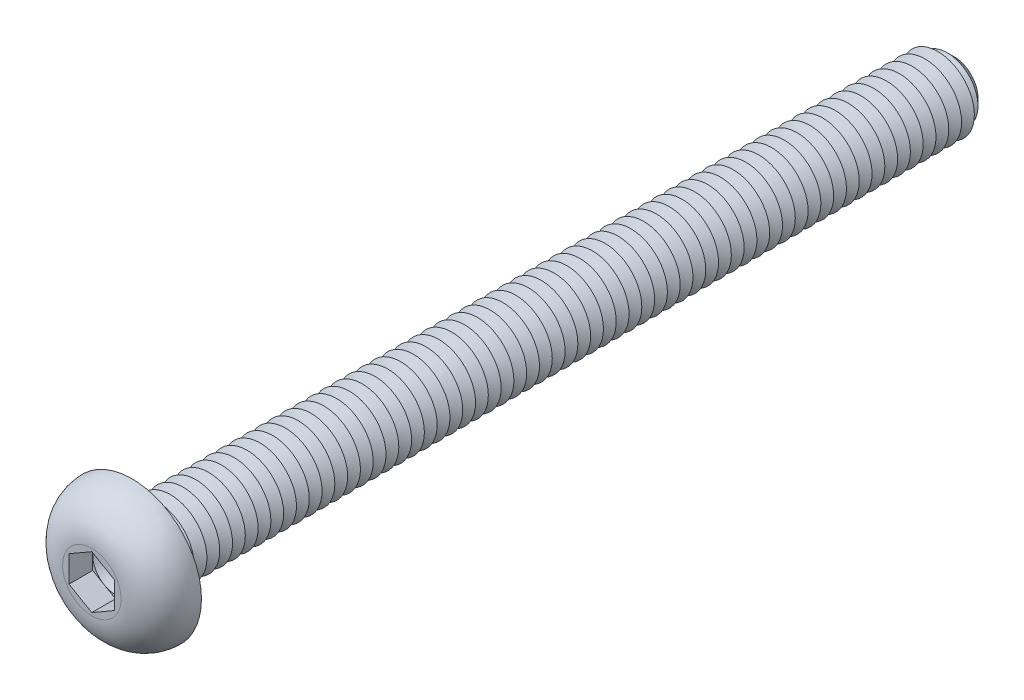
from build123d import *

# Parameters (mm, degrees)
CUT_EXTRUDE1_DEPTH  = 1.3
SKETCH4_R           = 2
BOSS_EXTRUDE1_DEPTH = 45
CHAMFER1_SIZE       = 0.7
LPATTERN1_COUNT     = 63
LPATTERN1_PITCH     = 0.7
FILLET2_R           = 0.3


with BuildPart() as part:
    # Sketch2 → Revolve1 (revolve)
    with BuildSketch(Plane(origin=(0, 0, 0), x_dir=(0, 0, -1), z_dir=(1, 0, 0)), mode=Mode.PRIVATE) as revolve1_sk:
        with BuildLine():
            Line((0, 0), (-2.2, 0))
            Line((-2.2, 0), (-2.2, 1.6))
            ThreePointArc((-2.2, 1.6), (-1.555634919, 3.155634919), (0, 3.8))
            Line((0, 3.8), (0, 0))
        make_face()
    revolve(revolve1_sk.sketch.rotate(Axis((0, 0, 47.934239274), (0, 0, -1)), 90), axis=Axis((0, 0, 47.934239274), (0, 0, -1)))

    # Sketch3 → Cut-Extrude1 (cut)
    with BuildSketch(Plane.XY.offset(2.2)):
        Polygon((0, 1.443375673), (-1.25, 0.721687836), (-1.25, -0.721687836), (0, -1.443375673), (1.25, -0.721687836), (1.25, 0.721687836), align=None)
    extrude(amount=-CUT_EXTRUDE1_DEPTH, mode=Mode.SUBTRACT)

    # Sketch4 → Boss-Extrude1 (add)
    with BuildSketch(Plane(origin=(0, 0, 0), x_dir=(-1, 0, 0), z_dir=(0, 0, -1))):
        with Locations(Location((0, 0, 0), (0, 0, 180))):
            Circle(SKETCH4_R)
    extrude(amount=BOSS_EXTRUDE1_DEPTH)

    # Chamfer1
    chamfer1_edges = [part.edges().sort_by_distance(p)[0] for p in [
        (-2, 0, -45),
    ]]
    chamfer(chamfer1_edges, length=CHAMFER1_SIZE)

    # Sketch5 → Cut-Revolve1 (revolve, cut)
    with BuildSketch(Plane(origin=(0, 0, 0), x_dir=(0, 0, -1), z_dir=(1, 0, 0)), mode=Mode.PRIVATE) as cut_revolve1_sk:
        Polygon((0.7, 2), (1.4, 2), (1.05, 1.393782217), align=None)
    cut_revolve1 = revolve(cut_revolve1_sk.sketch.rotate(Axis((0, 0, 47.934239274), (0, 0, -1)), 90), axis=Axis((0, 0, 47.934239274), (0, 0, -1)), mode=Mode.SUBTRACT)

    # LPattern1: Cut-Revolve1 ×63
    with Locations(*[(0, 0, -i * LPATTERN1_PITCH) for i in range(1, LPATTERN1_COUNT)]):
        add(cut_revolve1, mode=Mode.SUBTRACT)

    # Fillet2
    fillet2_edges = [part.edges().sort_by_distance(p)[0] for p in [
        (-2, 0, 0),
    ]]
    fillet(fillet2_edges, radius=FILLET2_R)

    # Cut-Extrude2 cone 1 section (on through the dimple's axis) → Cut-Extrude2 (revolve, cut)
    with BuildSketch(Plane(origin=(0, 0, 0.9), x_dir=(0, -1, 0), z_dir=(1, 0, 0))):
        Polygon((0, 0), (1.25, 0), (0, 0.721687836), align=None)
    revolve(axis=Axis((0, 0, 0.9), (0, 0, -1)), mode=Mode.SUBTRACT)


solid = part.part
